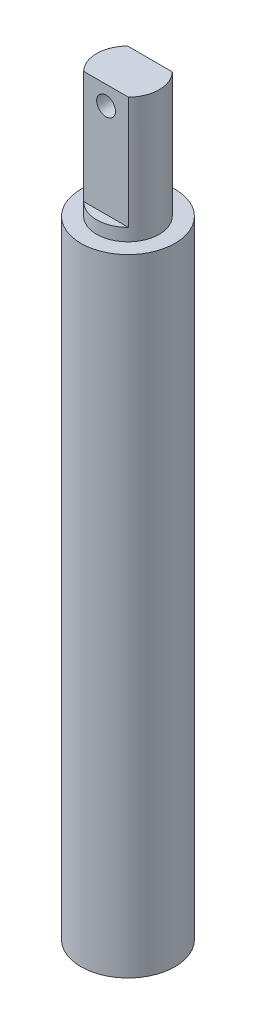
from build123d import *

# Parameters (mm, degrees)
SZKIC1_R                    = 7.5
SZKIC1_R_2                  = 5
DODANIE_WYCI_GNI_CIE1_DEPTH = 100
DODANIE_WYCI_GNI_CIE2_START = 60
SZKIC1_2_R                  = 5
DODANIE_WYCI_GNI_CIE2_DEPTH = 60
SZKIC2_OUTSIDE_W            = 41.372
SZKIC2_OUTSIDE_H            = 41.372
SZKIC2_OUTSIDE_W_2          = 10
SZKIC2_OUTSIDE_H_2          = 7
WYTNIJ_WYCI_GNI_CIE1_DEPTH  = 18
SZKIC3_R                    = 1.5
WYTNIJ_WYCI_GNI_CIE2_DEPTH  = 10


with BuildPart() as part:
    # Szkic1 → Dodanie-wyci_gni_cie1 (new body)
    with BuildSketch(Plane(origin=(0, 0, 0), x_dir=(1, 0, 0), z_dir=(0, 1, 0))):
        with Locations(Location((0, 0, 0), (0, 0, 270))):
            Circle(SZKIC1_R)
        with Locations(Location((0, 0, 0), (0, 0, 270))):
            Circle(SZKIC1_R_2, mode=Mode.SUBTRACT)
    extrude(amount=DODANIE_WYCI_GNI_CIE1_DEPTH)

    # Szkic1_2 → Dodanie-wyci_gni_cie2 (add)
    with BuildSketch(Plane(origin=(0, 0, 0), x_dir=(1, 0, 0), z_dir=(0, 1, 0)).offset(DODANIE_WYCI_GNI_CIE2_START)):
        with Locations(Location((0, 0, 0), (0, 0, 270))):
            Circle(SZKIC1_2_R)
    extrude(amount=DODANIE_WYCI_GNI_CIE2_DEPTH)

    # Szkic2 outside → Wytnij-wyci_gni_cie1 (cut)
    with BuildSketch(Plane(origin=(0, 120, 0), x_dir=(1, 0, 0), z_dir=(0, 1, 0))):
        Rectangle(SZKIC2_OUTSIDE_W, SZKIC2_OUTSIDE_H)
        Rectangle(SZKIC2_OUTSIDE_W_2, SZKIC2_OUTSIDE_H_2, mode=Mode.SUBTRACT)
    extrude(amount=-WYTNIJ_WYCI_GNI_CIE1_DEPTH, mode=Mode.SUBTRACT)

    # Szkic3 → Wytnij-wyci_gni_cie2 (cut)
    with BuildSketch(Plane.XY.offset(3.5)):
        with Locations((0, 117)):
            Circle(SZKIC3_R)
    extrude(amount=-WYTNIJ_WYCI_GNI_CIE2_DEPTH, mode=Mode.SUBTRACT)


solid = part.part
